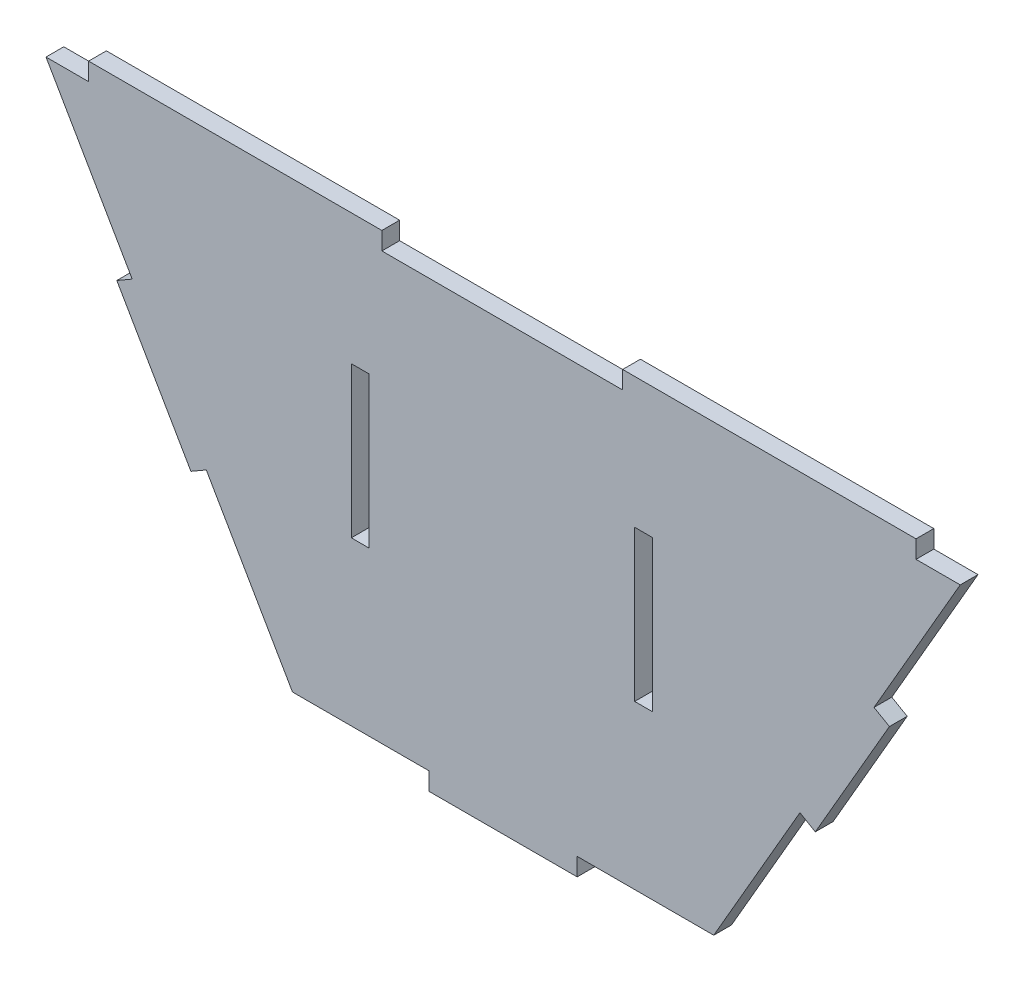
from build123d import *

# Parameters (mm, degrees)
SKETCH1_W           = 1.524
SKETCH1_H           = 12.933928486
BOSS_EXTRUDE1_DEPTH = 1.524


with BuildPart() as part:
    # Sketch1 → Boss-Extrude1 (new body)
    with BuildSketch(Plane.XY):
        Polygon((-35.542706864, 0), (-35.542706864, 1.524), (-10.396700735, 1.524), (-10.396700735, 0), (10.251163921, 0), (10.251163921, 1.524), (35.405242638, 1.524), (35.405242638, 0), (39.195470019, 0), (31.804234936, -12.794159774), (33.123855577, -13.556509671), (26.770939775, -24.553348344), (25.451319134, -23.790998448), (18.060084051, -36.585158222), (6.35, -36.585158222), (6.35, -38.109158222), (-6.35, -38.109158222), (-6.35, -36.585158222), (-18.060084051, -36.585158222), (-25.451319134, -23.790998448), (-26.770939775, -24.553348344), (-33.123855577, -13.556509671), (-31.804234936, -12.794159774), (-39.195470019, 0), align=None)
        with Locations((-12.25342431, -16.146943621)):
            Rectangle(SKETCH1_W, SKETCH1_H, mode=Mode.SUBTRACT)
        with Locations((12.041319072, -16.146943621)):
            Rectangle(SKETCH1_W, SKETCH1_H, mode=Mode.SUBTRACT)
    extrude(amount=BOSS_EXTRUDE1_DEPTH)


solid = part.part
